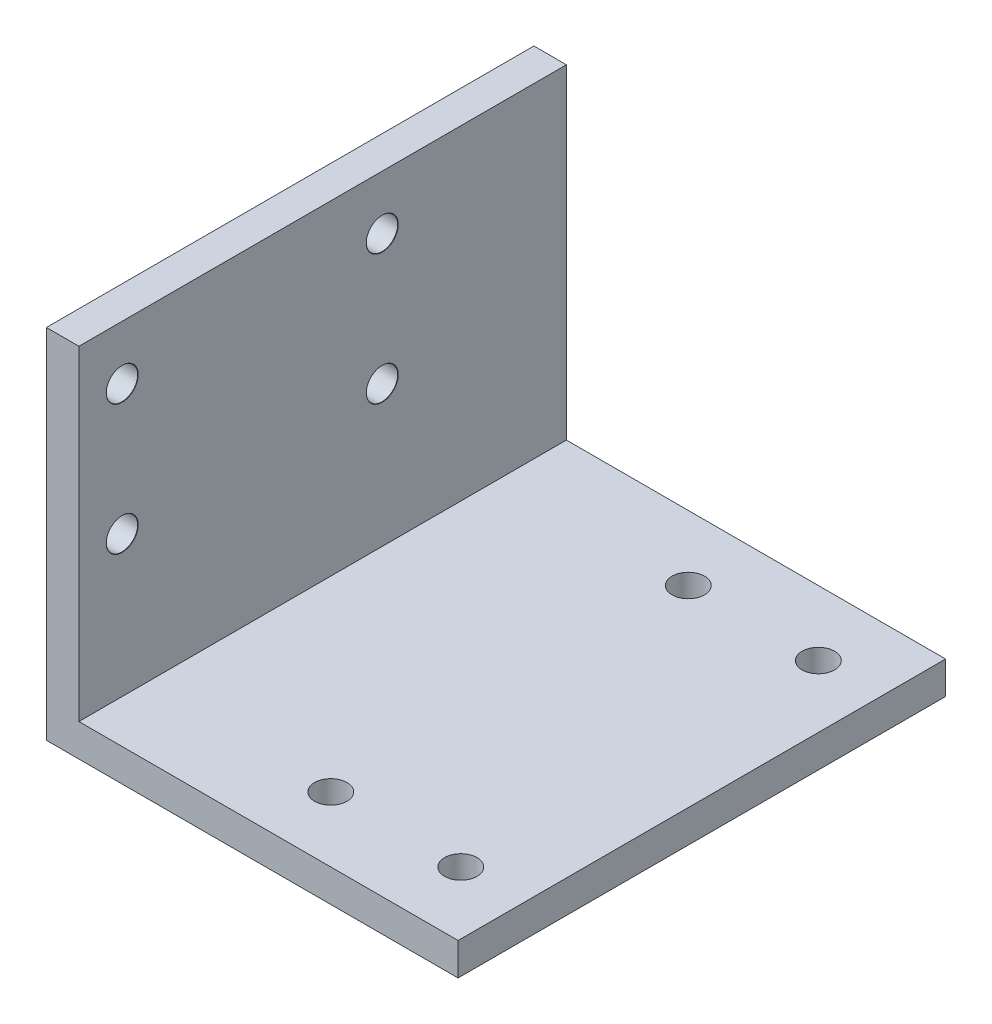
from build123d import *

# Parameters (mm, degrees)
SKETCH1_W                        = 38
SKETCH1_H                        = 45
SKETCH1_R                        = 1.5
BOSS_EXTRUDE1_DEPTH              = 3
SKETCH2_W                        = 3
SKETCH2_H                        = 45
BOSS_EXTRUDE2_DEPTH              = 30
M2_5_CLEARANCE_HOLE1_D           = 2.9
M2_5_CLEARANCE_HOLE1_DEPTH       = 5.478752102
M2_5_CLEARANCE_HOLE1_CSINK_D     = 2.95
M2_5_CLEARANCE_HOLE1_CSINK_ANGLE = 90
M2_5_CLEARANCE_HOLE1_TIP         = 0.871247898


with BuildPart() as part:
    # Sketch1 → Boss-Extrude1 (new body)
    with BuildSketch(Plane(origin=(0, 0, 0), x_dir=(1, 0, 0), z_dir=(0, 1, 0))):
        Rectangle(SKETCH1_W, SKETCH1_H)
        with Locations(Location((13.25, 16.5, 0), (0, 0, 270))):
            Circle(SKETCH1_R, mode=Mode.SUBTRACT)
        with Locations(Location((1.25, 16.5, 0), (0, 0, 270))):
            Circle(SKETCH1_R, mode=Mode.SUBTRACT)
        with Locations(Location((13.25, -16.5, 0), (0, 0, 90))):
            Circle(SKETCH1_R, mode=Mode.SUBTRACT)
        with Locations(Location((1.25, -16.5, 0), (0, 0, 90))):
            Circle(SKETCH1_R, mode=Mode.SUBTRACT)
    extrude(amount=BOSS_EXTRUDE1_DEPTH)

    # Sketch2 → Boss-Extrude2 (add)
    with BuildSketch(Plane(origin=(0, 3, 0), x_dir=(1, 0, 0), z_dir=(0, 1, 0))):
        with Locations((-17.5, 0)):
            Rectangle(SKETCH2_W, SKETCH2_H)
    extrude(amount=BOSS_EXTRUDE2_DEPTH)

    # M2.5 Clearance Hole1
    with Locations(Plane(origin=(-16, 0, 0), x_dir=(0, 0, -1), z_dir=(1, 0, 0))):
        with Locations((-18.5, 16), (5.5, 16), (5.5, 28), (-18.5, 28)):
            CounterSinkHole(M2_5_CLEARANCE_HOLE1_D / 2, M2_5_CLEARANCE_HOLE1_CSINK_D / 2, depth=M2_5_CLEARANCE_HOLE1_DEPTH, counter_sink_angle=M2_5_CLEARANCE_HOLE1_CSINK_ANGLE)
            with Locations((0, 0, -(M2_5_CLEARANCE_HOLE1_DEPTH + M2_5_CLEARANCE_HOLE1_TIP / 2))):  # 118° drill point
                Cone(0, M2_5_CLEARANCE_HOLE1_D / 2, M2_5_CLEARANCE_HOLE1_TIP, mode=Mode.SUBTRACT)


solid = part.part
